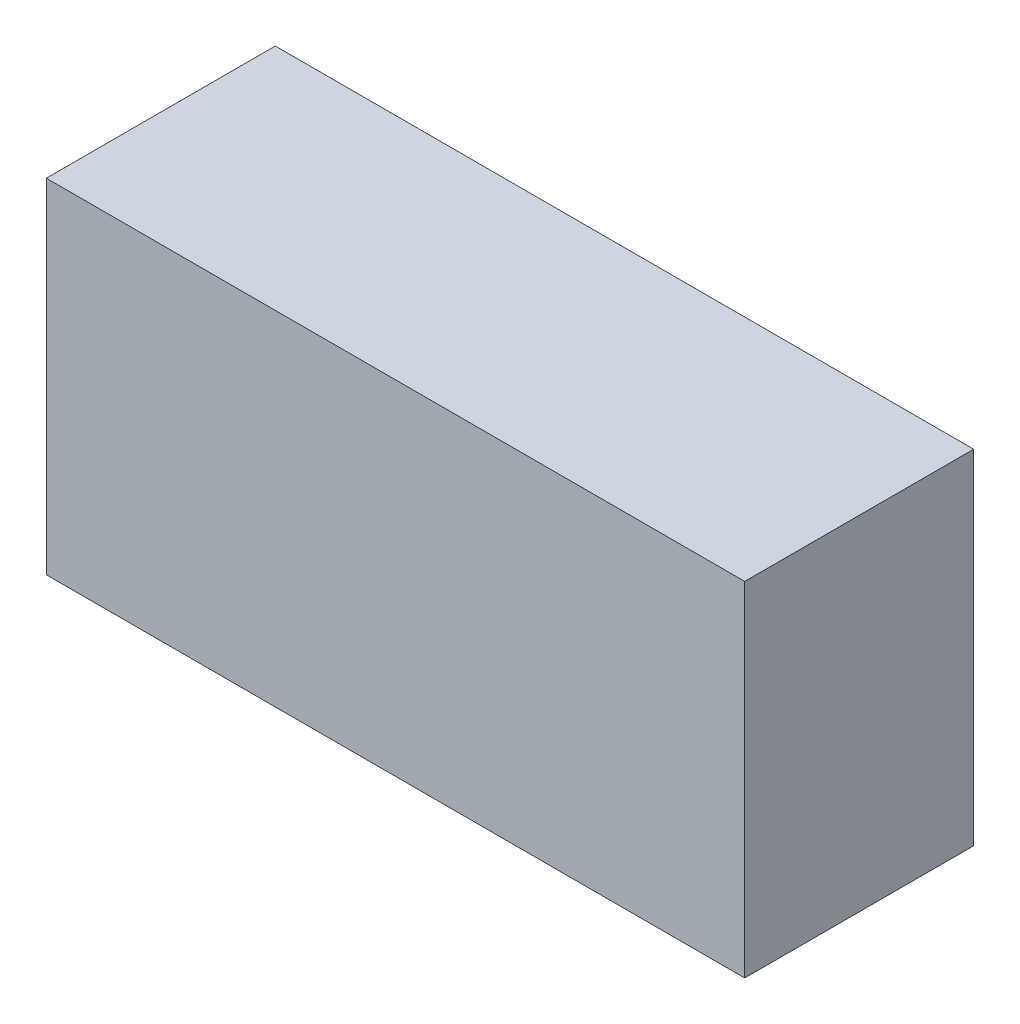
from build123d import *

# Parameters (mm, degrees)
GENERAL_W           = 3.050000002
GENERAL_H           = 1.500000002
BOSS_EXTRUDE1_DEPTH = 0.999999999


with BuildPart() as part:
    # GENERAL → Boss-Extrude1 (new body)
    with BuildSketch(Plane.XY):
        Rectangle(GENERAL_W, GENERAL_H)
    extrude(amount=BOSS_EXTRUDE1_DEPTH)


solid = part.part
